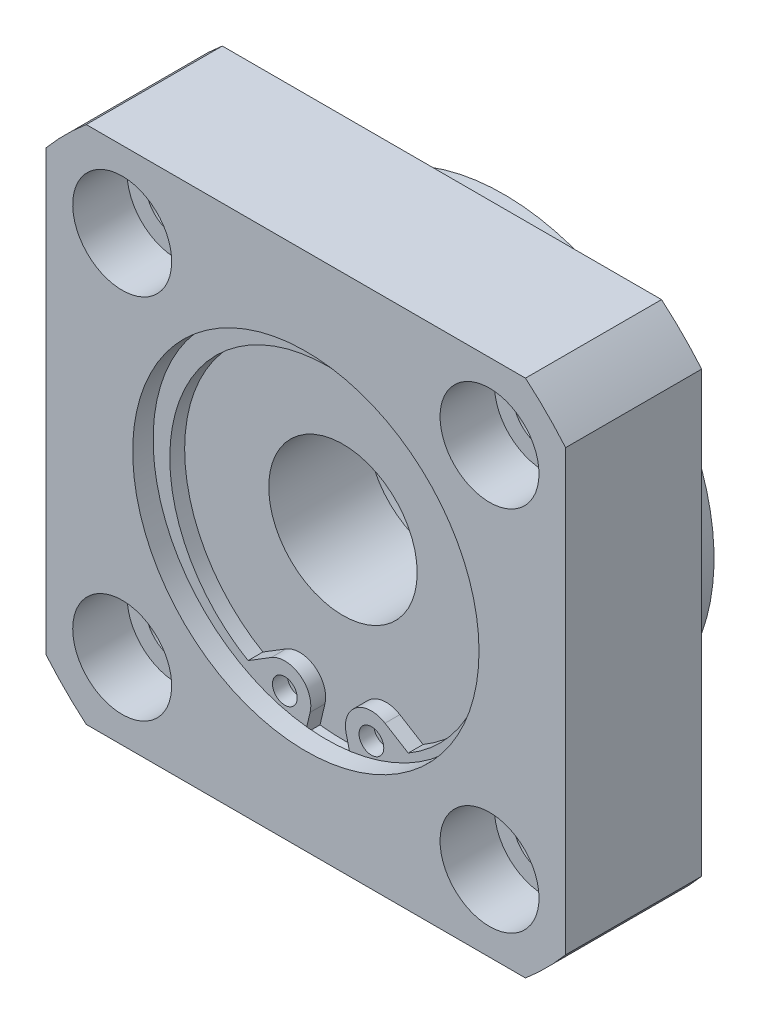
ISO-10303-21;
HEADER;
FILE_DESCRIPTION(('STEP AP214'),'2;1');
FILE_NAME('part.step','',(''),(''),'','','');
FILE_SCHEMA(('AUTOMOTIVE_DESIGN { 1 0 10303 214 1 1 1 1 }'));
ENDSEC;
DATA;
#1=APPLICATION_CONTEXT('core data for automotive mechanical design processes');
#2=APPLICATION_PROTOCOL_DEFINITION('international standard','automotive_design',2000,#1);
#3=PRODUCT_CONTEXT('',#1,'mechanical');
#4=PRODUCT('Part','Part','',(#3));
#5=PRODUCT_RELATED_PRODUCT_CATEGORY('part','',(#4));
#6=PRODUCT_DEFINITION_FORMATION('','',#4);
#7=PRODUCT_DEFINITION_CONTEXT('part definition',#1,'design');
#8=PRODUCT_DEFINITION('design','',#6,#7);
#9=PRODUCT_DEFINITION_SHAPE('','',#8);
#10=(LENGTH_UNIT() NAMED_UNIT(*) SI_UNIT(.MILLI.,.METRE.));
#11=(NAMED_UNIT(*) PLANE_ANGLE_UNIT() SI_UNIT($,.RADIAN.));
#12=(NAMED_UNIT(*) SI_UNIT($,.STERADIAN.) SOLID_ANGLE_UNIT());
#13=UNCERTAINTY_MEASURE_WITH_UNIT(LENGTH_MEASURE(1.E-05),#10,'distance_accuracy_value','');
#14=(GEOMETRIC_REPRESENTATION_CONTEXT(3) GLOBAL_UNCERTAINTY_ASSIGNED_CONTEXT((#13)) GLOBAL_UNIT_ASSIGNED_CONTEXT((#10,
#11,#12)) REPRESENTATION_CONTEXT('',''));
#15=CARTESIAN_POINT('',(0.,0.,0.));
#16=DIRECTION('',(0.,0.,1.));
#17=DIRECTION('',(1.,0.,0.));
#18=AXIS2_PLACEMENT_3D('',#15,#16,#17);
#19=CARTESIAN_POINT('',(14.8492424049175,14.8492424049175,0.));
#20=DIRECTION('',(0.,0.,1.));
#21=DIRECTION('',(1.,0.,0.));
#22=AXIS2_PLACEMENT_3D('',#19,#20,#21);
#23=CYLINDRICAL_SURFACE('',#22,2.5);
#24=CARTESIAN_POINT('',(14.8492424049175,14.8492424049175,0.));
#25=DIRECTION('',(0.,0.,1.));
#26=DIRECTION('',(1.,0.,0.));
#27=AXIS2_PLACEMENT_3D('',#24,#25,#26);
#28=CIRCLE('',#27,2.5);
#29=CARTESIAN_POINT('',(17.3492424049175,14.8492424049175,0.));
#30=VERTEX_POINT('',#29);
#31=EDGE_CURVE('E340',#30,#30,#28,.T.);
#32=ORIENTED_EDGE('',*,*,#31,.F.);
#33=EDGE_LOOP('',(#32));
#34=FACE_BOUND('',#33,.T.);
#35=CARTESIAN_POINT('',(14.8492424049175,14.8492424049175,6.6));
#36=DIRECTION('',(0.,0.,1.));
#37=DIRECTION('',(1.,0.,0.));
#38=AXIS2_PLACEMENT_3D('',#35,#36,#37);
#39=CIRCLE('',#38,2.5);
#40=CARTESIAN_POINT('',(17.3492424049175,14.8492424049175,6.6));
#41=VERTEX_POINT('',#40);
#42=EDGE_CURVE('E339',#41,#41,#39,.F.);
#43=ORIENTED_EDGE('',*,*,#42,.F.);
#44=EDGE_LOOP('',(#43));
#45=FACE_BOUND('',#44,.T.);
#46=ADVANCED_FACE('F14',(#34,#45),#23,.F.);
#47=CARTESIAN_POINT('',(14.8492424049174,-14.8492424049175,0.));
#48=DIRECTION('',(0.,0.,1.));
#49=DIRECTION('',(1.,0.,0.));
#50=AXIS2_PLACEMENT_3D('',#47,#48,#49);
#51=CYLINDRICAL_SURFACE('',#50,2.5);
#52=CARTESIAN_POINT('',(14.8492424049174,-14.8492424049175,0.));
#53=DIRECTION('',(0.,0.,1.));
#54=DIRECTION('',(0.,-1.,0.));
#55=AXIS2_PLACEMENT_3D('',#52,#53,#54);
#56=CIRCLE('',#55,2.5);
#57=CARTESIAN_POINT('',(14.8492424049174,-17.3492424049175,0.));
#58=VERTEX_POINT('',#57);
#59=EDGE_CURVE('E330',#58,#58,#56,.T.);
#60=ORIENTED_EDGE('',*,*,#59,.F.);
#61=EDGE_LOOP('',(#60));
#62=FACE_BOUND('',#61,.T.);
#63=CARTESIAN_POINT('',(14.8492424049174,-14.8492424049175,6.6));
#64=DIRECTION('',(0.,0.,1.));
#65=DIRECTION('',(1.,0.,0.));
#66=AXIS2_PLACEMENT_3D('',#63,#64,#65);
#67=CIRCLE('',#66,2.5);
#68=CARTESIAN_POINT('',(17.3492424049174,-14.8492424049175,6.6));
#69=VERTEX_POINT('',#68);
#70=EDGE_CURVE('E323',#69,#69,#67,.F.);
#71=ORIENTED_EDGE('',*,*,#70,.F.);
#72=EDGE_LOOP('',(#71));
#73=FACE_BOUND('',#72,.T.);
#74=ADVANCED_FACE('F169',(#62,#73),#51,.F.);
#75=CARTESIAN_POINT('',(-14.8492424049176,-14.8492424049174,0.));
#76=DIRECTION('',(0.,0.,1.));
#77=DIRECTION('',(1.,0.,0.));
#78=AXIS2_PLACEMENT_3D('',#75,#76,#77);
#79=CYLINDRICAL_SURFACE('',#78,2.5);
#80=CARTESIAN_POINT('',(-14.8492424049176,-14.8492424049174,0.));
#81=DIRECTION('',(0.,0.,1.));
#82=DIRECTION('',(-1.,0.,0.));
#83=AXIS2_PLACEMENT_3D('',#80,#81,#82);
#84=CIRCLE('',#83,2.5);
#85=CARTESIAN_POINT('',(-17.3492424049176,-14.8492424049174,0.));
#86=VERTEX_POINT('',#85);
#87=EDGE_CURVE('E327',#86,#86,#84,.T.);
#88=ORIENTED_EDGE('',*,*,#87,.F.);
#89=EDGE_LOOP('',(#88));
#90=FACE_BOUND('',#89,.T.);
#91=CARTESIAN_POINT('',(-14.8492424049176,-14.8492424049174,6.6));
#92=DIRECTION('',(0.,0.,1.));
#93=DIRECTION('',(1.,0.,0.));
#94=AXIS2_PLACEMENT_3D('',#91,#92,#93);
#95=CIRCLE('',#94,2.5);
#96=CARTESIAN_POINT('',(-12.3492424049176,-14.8492424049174,6.6));
#97=VERTEX_POINT('',#96);
#98=EDGE_CURVE('E316',#97,#97,#95,.F.);
#99=ORIENTED_EDGE('',*,*,#98,.F.);
#100=EDGE_LOOP('',(#99));
#101=FACE_BOUND('',#100,.T.);
#102=ADVANCED_FACE('F175',(#90,#101),#79,.F.);
#103=CARTESIAN_POINT('',(-14.8492424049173,14.8492424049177,0.));
#104=DIRECTION('',(0.,0.,1.));
#105=DIRECTION('',(1.,0.,0.));
#106=AXIS2_PLACEMENT_3D('',#103,#104,#105);
#107=CYLINDRICAL_SURFACE('',#106,2.5);
#108=CARTESIAN_POINT('',(-14.8492424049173,14.8492424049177,0.));
#109=DIRECTION('',(0.,0.,1.));
#110=DIRECTION('',(0.,1.,0.));
#111=AXIS2_PLACEMENT_3D('',#108,#109,#110);
#112=CIRCLE('',#111,2.5);
#113=CARTESIAN_POINT('',(-14.8492424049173,17.3492424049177,0.));
#114=VERTEX_POINT('',#113);
#115=EDGE_CURVE('E324',#114,#114,#112,.T.);
#116=ORIENTED_EDGE('',*,*,#115,.F.);
#117=EDGE_LOOP('',(#116));
#118=FACE_BOUND('',#117,.T.);
#119=CARTESIAN_POINT('',(-14.8492424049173,14.8492424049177,6.6));
#120=DIRECTION('',(0.,0.,1.));
#121=DIRECTION('',(1.,0.,0.));
#122=AXIS2_PLACEMENT_3D('',#119,#120,#121);
#123=CIRCLE('',#122,2.5);
#124=CARTESIAN_POINT('',(-12.3492424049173,14.8492424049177,6.6));
#125=VERTEX_POINT('',#124);
#126=EDGE_CURVE('E309',#125,#125,#123,.F.);
#127=ORIENTED_EDGE('',*,*,#126,.F.);
#128=EDGE_LOOP('',(#127));
#129=FACE_BOUND('',#128,.T.);
#130=ADVANCED_FACE('F784',(#118,#129),#107,.F.);
#131=CARTESIAN_POINT('',(0.,0.,-5.));
#132=DIRECTION('',(0.,0.,1.));
#133=DIRECTION('',(1.,0.,0.));
#134=AXIS2_PLACEMENT_3D('',#131,#132,#133);
#135=CYLINDRICAL_SURFACE('',#134,17.);
#136=CARTESIAN_POINT('',(0.,0.,-5.));
#137=DIRECTION('',(0.,0.,-1.));
#138=DIRECTION('',(-1.,0.,0.));
#139=AXIS2_PLACEMENT_3D('',#136,#137,#138);
#140=CIRCLE('',#139,17.);
#141=CARTESIAN_POINT('',(-17.,0.,-5.));
#142=VERTEX_POINT('',#141);
#143=EDGE_CURVE('E292',#142,#142,#140,.T.);
#144=ORIENTED_EDGE('',*,*,#143,.F.);
#145=EDGE_LOOP('',(#144));
#146=FACE_BOUND('',#145,.T.);
#147=CARTESIAN_POINT('',(0.,0.,0.));
#148=DIRECTION('',(0.,0.,-1.));
#149=DIRECTION('',(-1.,0.,0.));
#150=AXIS2_PLACEMENT_3D('',#147,#148,#149);
#151=CIRCLE('',#150,17.);
#152=CARTESIAN_POINT('',(-17.,0.,0.));
#153=VERTEX_POINT('',#152);
#154=EDGE_CURVE('E293',#153,#153,#151,.T.);
#155=ORIENTED_EDGE('',*,*,#154,.T.);
#156=EDGE_LOOP('',(#155));
#157=FACE_BOUND('',#156,.T.);
#158=ADVANCED_FACE('F194',(#146,#157),#135,.T.);
#159=CARTESIAN_POINT('',(0.,0.,0.));
#160=DIRECTION('',(0.,0.,-1.));
#161=DIRECTION('',(-1.,0.,0.));
#162=AXIS2_PLACEMENT_3D('',#159,#160,#161);
#163=PLANE('',#162);
#164=ORIENTED_EDGE('',*,*,#154,.F.);
#165=EDGE_LOOP('',(#164));
#166=FACE_BOUND('',#165,.T.);
#167=ORIENTED_EDGE('',*,*,#115,.T.);
#168=EDGE_LOOP('',(#167));
#169=FACE_BOUND('',#168,.T.);
#170=ORIENTED_EDGE('',*,*,#87,.T.);
#171=EDGE_LOOP('',(#170));
#172=FACE_BOUND('',#171,.T.);
#173=ORIENTED_EDGE('',*,*,#59,.T.);
#174=EDGE_LOOP('',(#173));
#175=FACE_BOUND('',#174,.T.);
#176=ORIENTED_EDGE('',*,*,#31,.T.);
#177=EDGE_LOOP('',(#176));
#178=FACE_BOUND('',#177,.T.);
#179=CARTESIAN_POINT('',(0.,0.,0.));
#180=DIRECTION('',(0.,0.,-1.));
#181=DIRECTION('',(-1.,0.,0.));
#182=AXIS2_PLACEMENT_3D('',#179,#180,#181);
#183=CIRCLE('',#182,27.5);
#184=CARTESIAN_POINT('',(21.,-17.7552809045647,0.));
#185=VERTEX_POINT('',#184);
#186=CARTESIAN_POINT('',(17.7552809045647,-21.,0.));
#187=VERTEX_POINT('',#186);
#188=EDGE_CURVE('E346',#185,#187,#183,.T.);
#189=ORIENTED_EDGE('',*,*,#188,.T.);
#190=DIRECTION('',(1.,0.,0.));
#191=VECTOR('',#190,1.);
#192=CARTESIAN_POINT('',(-17.7552809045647,-21.,0.));
#193=LINE('',#192,#191);
#194=CARTESIAN_POINT('',(-17.7552809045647,-21.,0.));
#195=VERTEX_POINT('',#194);
#196=EDGE_CURVE('E349',#195,#187,#193,.T.);
#197=ORIENTED_EDGE('',*,*,#196,.F.);
#198=CARTESIAN_POINT('',(0.,0.,0.));
#199=DIRECTION('',(0.,0.,1.));
#200=DIRECTION('',(1.,0.,0.));
#201=AXIS2_PLACEMENT_3D('',#198,#199,#200);
#202=CIRCLE('',#201,27.5);
#203=CARTESIAN_POINT('',(-21.,-17.7552809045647,0.));
#204=VERTEX_POINT('',#203);
#205=EDGE_CURVE('E352',#204,#195,#202,.T.);
#206=ORIENTED_EDGE('',*,*,#205,.F.);
#207=DIRECTION('',(0.,-1.,0.));
#208=VECTOR('',#207,1.);
#209=CARTESIAN_POINT('',(-21.,17.7552809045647,0.));
#210=LINE('',#209,#208);
#211=CARTESIAN_POINT('',(-21.,17.7552809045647,0.));
#212=VERTEX_POINT('',#211);
#213=EDGE_CURVE('E355',#212,#204,#210,.T.);
#214=ORIENTED_EDGE('',*,*,#213,.F.);
#215=CARTESIAN_POINT('',(0.,0.,0.));
#216=DIRECTION('',(0.,0.,-1.));
#217=DIRECTION('',(-1.,0.,0.));
#218=AXIS2_PLACEMENT_3D('',#215,#216,#217);
#219=CIRCLE('',#218,27.5);
#220=CARTESIAN_POINT('',(-17.7552809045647,21.,0.));
#221=VERTEX_POINT('',#220);
#222=EDGE_CURVE('E358',#212,#221,#219,.T.);
#223=ORIENTED_EDGE('',*,*,#222,.T.);
#224=DIRECTION('',(1.,0.,0.));
#225=VECTOR('',#224,1.);
#226=CARTESIAN_POINT('',(-17.7552809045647,21.,0.));
#227=LINE('',#226,#225);
#228=CARTESIAN_POINT('',(17.7552809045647,21.,0.));
#229=VERTEX_POINT('',#228);
#230=EDGE_CURVE('E361',#221,#229,#227,.T.);
#231=ORIENTED_EDGE('',*,*,#230,.T.);
#232=CARTESIAN_POINT('',(0.,0.,0.));
#233=DIRECTION('',(0.,0.,1.));
#234=DIRECTION('',(1.,0.,0.));
#235=AXIS2_PLACEMENT_3D('',#232,#233,#234);
#236=CIRCLE('',#235,27.5);
#237=CARTESIAN_POINT('',(21.,17.7552809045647,0.));
#238=VERTEX_POINT('',#237);
#239=EDGE_CURVE('E364',#238,#229,#236,.T.);
#240=ORIENTED_EDGE('',*,*,#239,.F.);
#241=DIRECTION('',(0.,-1.,0.));
#242=VECTOR('',#241,1.);
#243=CARTESIAN_POINT('',(21.,17.7552809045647,0.));
#244=LINE('',#243,#242);
#245=EDGE_CURVE('E367',#238,#185,#244,.T.);
#246=ORIENTED_EDGE('',*,*,#245,.T.);
#247=EDGE_LOOP('',(#189,#197,#206,#214,#223,#231,#240,#246));
#248=FACE_BOUND('',#247,.T.);
#249=ADVANCED_FACE('F190',(#166,#169,#172,#175,#178,#248),#163,.T.);
#250=CARTESIAN_POINT('',(14.8492424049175,14.8492424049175,6.6));
#251=DIRECTION('',(0.,0.,1.));
#252=DIRECTION('',(1.,0.,0.));
#253=AXIS2_PLACEMENT_3D('',#250,#251,#252);
#254=PLANE('',#253);
#255=CARTESIAN_POINT('',(14.8492424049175,14.8492424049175,6.6));
#256=DIRECTION('',(0.,0.,1.));
#257=DIRECTION('',(1.,0.,0.));
#258=AXIS2_PLACEMENT_3D('',#255,#256,#257);
#259=CIRCLE('',#258,4.);
#260=CARTESIAN_POINT('',(18.8492424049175,14.8492424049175,6.6));
#261=VERTEX_POINT('',#260);
#262=EDGE_CURVE('E336',#261,#261,#259,.T.);
#263=ORIENTED_EDGE('',*,*,#262,.T.);
#264=EDGE_LOOP('',(#263));
#265=FACE_BOUND('',#264,.T.);
#266=ORIENTED_EDGE('',*,*,#42,.T.);
#267=EDGE_LOOP('',(#266));
#268=FACE_BOUND('',#267,.T.);
#269=ADVANCED_FACE('F193',(#265,#268),#254,.T.);
#270=CARTESIAN_POINT('',(14.8492424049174,-14.8492424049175,6.6));
#271=DIRECTION('',(0.,0.,1.));
#272=DIRECTION('',(0.,-1.,0.));
#273=AXIS2_PLACEMENT_3D('',#270,#271,#272);
#274=PLANE('',#273);
#275=CARTESIAN_POINT('',(14.8492424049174,-14.8492424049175,6.6));
#276=DIRECTION('',(0.,0.,1.));
#277=DIRECTION('',(0.,-1.,0.));
#278=AXIS2_PLACEMENT_3D('',#275,#276,#277);
#279=CIRCLE('',#278,4.);
#280=CARTESIAN_POINT('',(14.8492424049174,-18.8492424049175,6.6));
#281=VERTEX_POINT('',#280);
#282=EDGE_CURVE('E320',#281,#281,#279,.T.);
#283=ORIENTED_EDGE('',*,*,#282,.T.);
#284=EDGE_LOOP('',(#283));
#285=FACE_BOUND('',#284,.T.);
#286=ORIENTED_EDGE('',*,*,#70,.T.);
#287=EDGE_LOOP('',(#286));
#288=FACE_BOUND('',#287,.T.);
#289=ADVANCED_FACE('F791',(#285,#288),#274,.T.);
#290=CARTESIAN_POINT('',(-14.8492424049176,-14.8492424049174,6.6));
#291=DIRECTION('',(0.,0.,1.));
#292=DIRECTION('',(-1.,0.,0.));
#293=AXIS2_PLACEMENT_3D('',#290,#291,#292);
#294=PLANE('',#293);
#295=CARTESIAN_POINT('',(-14.8492424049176,-14.8492424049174,6.6));
#296=DIRECTION('',(0.,0.,1.));
#297=DIRECTION('',(-1.,0.,0.));
#298=AXIS2_PLACEMENT_3D('',#295,#296,#297);
#299=CIRCLE('',#298,4.);
#300=CARTESIAN_POINT('',(-18.8492424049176,-14.8492424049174,6.6));
#301=VERTEX_POINT('',#300);
#302=EDGE_CURVE('E313',#301,#301,#299,.T.);
#303=ORIENTED_EDGE('',*,*,#302,.T.);
#304=EDGE_LOOP('',(#303));
#305=FACE_BOUND('',#304,.T.);
#306=ORIENTED_EDGE('',*,*,#98,.T.);
#307=EDGE_LOOP('',(#306));
#308=FACE_BOUND('',#307,.T.);
#309=ADVANCED_FACE('F808',(#305,#308),#294,.T.);
#310=CARTESIAN_POINT('',(-14.8492424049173,14.8492424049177,6.6));
#311=DIRECTION('',(0.,0.,1.));
#312=DIRECTION('',(0.,1.,0.));
#313=AXIS2_PLACEMENT_3D('',#310,#311,#312);
#314=PLANE('',#313);
#315=CARTESIAN_POINT('',(-14.8492424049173,14.8492424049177,6.6));
#316=DIRECTION('',(0.,0.,1.));
#317=DIRECTION('',(0.,1.,0.));
#318=AXIS2_PLACEMENT_3D('',#315,#316,#317);
#319=CIRCLE('',#318,4.);
#320=CARTESIAN_POINT('',(-14.8492424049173,18.8492424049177,6.6));
#321=VERTEX_POINT('',#320);
#322=EDGE_CURVE('E306',#321,#321,#319,.T.);
#323=ORIENTED_EDGE('',*,*,#322,.T.);
#324=EDGE_LOOP('',(#323));
#325=FACE_BOUND('',#324,.T.);
#326=ORIENTED_EDGE('',*,*,#126,.T.);
#327=EDGE_LOOP('',(#326));
#328=FACE_BOUND('',#327,.T.);
#329=ADVANCED_FACE('F818',(#325,#328),#314,.T.);
#330=CARTESIAN_POINT('',(0.,0.,-5.));
#331=DIRECTION('',(0.,0.,-1.));
#332=DIRECTION('',(-1.,0.,0.));
#333=AXIS2_PLACEMENT_3D('',#330,#331,#332);
#334=PLANE('',#333);
#335=ORIENTED_EDGE('',*,*,#143,.T.);
#336=EDGE_LOOP('',(#335));
#337=FACE_BOUND('',#336,.T.);
#338=CARTESIAN_POINT('',(0.,0.,-5.));
#339=DIRECTION('',(0.,0.,-1.));
#340=DIRECTION('',(-1.,0.,0.));
#341=AXIS2_PLACEMENT_3D('',#338,#339,#340);
#342=CIRCLE('',#341,12.);
#343=CARTESIAN_POINT('',(-12.,0.,-5.));
#344=VERTEX_POINT('',#343);
#345=EDGE_CURVE('E289',#344,#344,#342,.T.);
#346=ORIENTED_EDGE('',*,*,#345,.F.);
#347=EDGE_LOOP('',(#346));
#348=FACE_BOUND('',#347,.T.);
#349=ADVANCED_FACE('F211',(#337,#348),#334,.T.);
#350=CARTESIAN_POINT('',(-17.7552809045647,-21.,11.));
#351=DIRECTION('',(0.,1.,0.));
#352=DIRECTION('',(0.,0.,1.));
#353=AXIS2_PLACEMENT_3D('',#350,#351,#352);
#354=PLANE('',#353);
#355=DIRECTION('',(1.,0.,0.));
#356=VECTOR('',#355,1.);
#357=CARTESIAN_POINT('',(-17.7552809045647,-21.,11.));
#358=LINE('',#357,#356);
#359=CARTESIAN_POINT('',(-17.7552809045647,-21.,11.));
#360=VERTEX_POINT('',#359);
#361=CARTESIAN_POINT('',(17.7552809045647,-21.,11.));
#362=VERTEX_POINT('',#361);
#363=EDGE_CURVE('E373',#360,#362,#358,.T.);
#364=ORIENTED_EDGE('',*,*,#363,.F.);
#365=DIRECTION('',(0.,0.,-1.));
#366=VECTOR('',#365,1.);
#367=CARTESIAN_POINT('',(-17.7552809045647,-21.,11.));
#368=LINE('',#367,#366);
#369=EDGE_CURVE('E397',#360,#195,#368,.T.);
#370=ORIENTED_EDGE('',*,*,#369,.T.);
#371=ORIENTED_EDGE('',*,*,#196,.T.);
#372=DIRECTION('',(0.,0.,-1.));
#373=VECTOR('',#372,1.);
#374=CARTESIAN_POINT('',(17.7552809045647,-21.,11.));
#375=LINE('',#374,#373);
#376=EDGE_CURVE('E394',#362,#187,#375,.T.);
#377=ORIENTED_EDGE('',*,*,#376,.F.);
#378=EDGE_LOOP('',(#364,#370,#371,#377));
#379=FACE_BOUND('',#378,.T.);
#380=ADVANCED_FACE('F207',(#379),#354,.F.);
#381=CARTESIAN_POINT('',(0.,0.,11.));
#382=DIRECTION('',(0.,0.,-1.));
#383=DIRECTION('',(-1.,0.,0.));
#384=AXIS2_PLACEMENT_3D('',#381,#382,#383);
#385=CYLINDRICAL_SURFACE('',#384,27.5);
#386=ORIENTED_EDGE('',*,*,#369,.F.);
#387=CARTESIAN_POINT('',(0.,0.,11.));
#388=DIRECTION('',(0.,0.,1.));
#389=DIRECTION('',(1.,0.,0.));
#390=AXIS2_PLACEMENT_3D('',#387,#388,#389);
#391=CIRCLE('',#390,27.5);
#392=CARTESIAN_POINT('',(-21.,-17.7552809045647,11.));
#393=VERTEX_POINT('',#392);
#394=EDGE_CURVE('E376',#393,#360,#391,.T.);
#395=ORIENTED_EDGE('',*,*,#394,.F.);
#396=DIRECTION('',(0.,0.,-1.));
#397=VECTOR('',#396,1.);
#398=CARTESIAN_POINT('',(-21.,-17.7552809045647,11.));
#399=LINE('',#398,#397);
#400=EDGE_CURVE('E400',#393,#204,#399,.T.);
#401=ORIENTED_EDGE('',*,*,#400,.T.);
#402=ORIENTED_EDGE('',*,*,#205,.T.);
#403=EDGE_LOOP('',(#386,#395,#401,#402));
#404=FACE_BOUND('',#403,.T.);
#405=ADVANCED_FACE('F210',(#404),#385,.T.);
#406=CARTESIAN_POINT('',(-21.,17.7552809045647,11.));
#407=DIRECTION('',(1.,0.,0.));
#408=DIRECTION('',(0.,0.,-1.));
#409=AXIS2_PLACEMENT_3D('',#406,#407,#408);
#410=PLANE('',#409);
#411=ORIENTED_EDGE('',*,*,#400,.F.);
#412=DIRECTION('',(0.,-1.,0.));
#413=VECTOR('',#412,1.);
#414=CARTESIAN_POINT('',(-21.,17.7552809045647,11.));
#415=LINE('',#414,#413);
#416=CARTESIAN_POINT('',(-21.,17.7552809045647,11.));
#417=VERTEX_POINT('',#416);
#418=EDGE_CURVE('E379',#417,#393,#415,.T.);
#419=ORIENTED_EDGE('',*,*,#418,.F.);
#420=DIRECTION('',(0.,0.,-1.));
#421=VECTOR('',#420,1.);
#422=CARTESIAN_POINT('',(-21.,17.7552809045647,11.));
#423=LINE('',#422,#421);
#424=EDGE_CURVE('E403',#417,#212,#423,.T.);
#425=ORIENTED_EDGE('',*,*,#424,.T.);
#426=ORIENTED_EDGE('',*,*,#213,.T.);
#427=EDGE_LOOP('',(#411,#419,#425,#426));
#428=FACE_BOUND('',#427,.T.);
#429=ADVANCED_FACE('F215',(#428),#410,.F.);
#430=CARTESIAN_POINT('',(0.,0.,11.));
#431=DIRECTION('',(0.,0.,-1.));
#432=DIRECTION('',(-1.,0.,0.));
#433=AXIS2_PLACEMENT_3D('',#430,#431,#432);
#434=CYLINDRICAL_SURFACE('',#433,27.5);
#435=ORIENTED_EDGE('',*,*,#424,.F.);
#436=CARTESIAN_POINT('',(0.,0.,11.));
#437=DIRECTION('',(0.,0.,-1.));
#438=DIRECTION('',(-1.,0.,0.));
#439=AXIS2_PLACEMENT_3D('',#436,#437,#438);
#440=CIRCLE('',#439,27.5);
#441=CARTESIAN_POINT('',(-17.7552809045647,21.,11.));
#442=VERTEX_POINT('',#441);
#443=EDGE_CURVE('E382',#417,#442,#440,.T.);
#444=ORIENTED_EDGE('',*,*,#443,.T.);
#445=DIRECTION('',(0.,0.,-1.));
#446=VECTOR('',#445,1.);
#447=CARTESIAN_POINT('',(-17.7552809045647,21.,11.));
#448=LINE('',#447,#446);
#449=EDGE_CURVE('E406',#442,#221,#448,.T.);
#450=ORIENTED_EDGE('',*,*,#449,.T.);
#451=ORIENTED_EDGE('',*,*,#222,.F.);
#452=EDGE_LOOP('',(#435,#444,#450,#451));
#453=FACE_BOUND('',#452,.T.);
#454=ADVANCED_FACE('F219',(#453),#434,.T.);
#455=CARTESIAN_POINT('',(-17.7552809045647,21.,11.));
#456=DIRECTION('',(0.,1.,0.));
#457=DIRECTION('',(0.,0.,1.));
#458=AXIS2_PLACEMENT_3D('',#455,#456,#457);
#459=PLANE('',#458);
#460=ORIENTED_EDGE('',*,*,#449,.F.);
#461=DIRECTION('',(1.,0.,0.));
#462=VECTOR('',#461,1.);
#463=CARTESIAN_POINT('',(-17.7552809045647,21.,11.));
#464=LINE('',#463,#462);
#465=CARTESIAN_POINT('',(17.7552809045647,21.,11.));
#466=VERTEX_POINT('',#465);
#467=EDGE_CURVE('E385',#442,#466,#464,.T.);
#468=ORIENTED_EDGE('',*,*,#467,.T.);
#469=DIRECTION('',(0.,0.,-1.));
#470=VECTOR('',#469,1.);
#471=CARTESIAN_POINT('',(17.7552809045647,21.,11.));
#472=LINE('',#471,#470);
#473=EDGE_CURVE('E409',#466,#229,#472,.T.);
#474=ORIENTED_EDGE('',*,*,#473,.T.);
#475=ORIENTED_EDGE('',*,*,#230,.F.);
#476=EDGE_LOOP('',(#460,#468,#474,#475));
#477=FACE_BOUND('',#476,.T.);
#478=ADVANCED_FACE('F223',(#477),#459,.T.);
#479=CARTESIAN_POINT('',(0.,0.,11.));
#480=DIRECTION('',(0.,0.,-1.));
#481=DIRECTION('',(-1.,0.,0.));
#482=AXIS2_PLACEMENT_3D('',#479,#480,#481);
#483=CYLINDRICAL_SURFACE('',#482,27.5);
#484=ORIENTED_EDGE('',*,*,#473,.F.);
#485=CARTESIAN_POINT('',(0.,0.,11.));
#486=DIRECTION('',(0.,0.,1.));
#487=DIRECTION('',(1.,0.,0.));
#488=AXIS2_PLACEMENT_3D('',#485,#486,#487);
#489=CIRCLE('',#488,27.5);
#490=CARTESIAN_POINT('',(21.,17.7552809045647,11.));
#491=VERTEX_POINT('',#490);
#492=EDGE_CURVE('E388',#491,#466,#489,.T.);
#493=ORIENTED_EDGE('',*,*,#492,.F.);
#494=DIRECTION('',(0.,0.,-1.));
#495=VECTOR('',#494,1.);
#496=CARTESIAN_POINT('',(21.,17.7552809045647,11.));
#497=LINE('',#496,#495);
#498=EDGE_CURVE('E412',#491,#238,#497,.T.);
#499=ORIENTED_EDGE('',*,*,#498,.T.);
#500=ORIENTED_EDGE('',*,*,#239,.T.);
#501=EDGE_LOOP('',(#484,#493,#499,#500));
#502=FACE_BOUND('',#501,.T.);
#503=ADVANCED_FACE('F227',(#502),#483,.T.);
#504=CARTESIAN_POINT('',(21.,17.7552809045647,11.));
#505=DIRECTION('',(1.,0.,0.));
#506=DIRECTION('',(0.,0.,-1.));
#507=AXIS2_PLACEMENT_3D('',#504,#505,#506);
#508=PLANE('',#507);
#509=ORIENTED_EDGE('',*,*,#498,.F.);
#510=DIRECTION('',(0.,-1.,0.));
#511=VECTOR('',#510,1.);
#512=CARTESIAN_POINT('',(21.,17.7552809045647,11.));
#513=LINE('',#512,#511);
#514=CARTESIAN_POINT('',(21.,-17.7552809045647,11.));
#515=VERTEX_POINT('',#514);
#516=EDGE_CURVE('E391',#491,#515,#513,.T.);
#517=ORIENTED_EDGE('',*,*,#516,.T.);
#518=DIRECTION('',(0.,0.,-1.));
#519=VECTOR('',#518,1.);
#520=CARTESIAN_POINT('',(21.,-17.7552809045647,11.));
#521=LINE('',#520,#519);
#522=EDGE_CURVE('E297',#515,#185,#521,.T.);
#523=ORIENTED_EDGE('',*,*,#522,.T.);
#524=ORIENTED_EDGE('',*,*,#245,.F.);
#525=EDGE_LOOP('',(#509,#517,#523,#524));
#526=FACE_BOUND('',#525,.T.);
#527=ADVANCED_FACE('F205',(#526),#508,.T.);
#528=CARTESIAN_POINT('',(0.,0.,11.));
#529=DIRECTION('',(0.,0.,-1.));
#530=DIRECTION('',(-1.,0.,0.));
#531=AXIS2_PLACEMENT_3D('',#528,#529,#530);
#532=CYLINDRICAL_SURFACE('',#531,27.5);
#533=ORIENTED_EDGE('',*,*,#522,.F.);
#534=CARTESIAN_POINT('',(0.,0.,11.));
#535=DIRECTION('',(0.,0.,-1.));
#536=DIRECTION('',(-1.,0.,0.));
#537=AXIS2_PLACEMENT_3D('',#534,#535,#536);
#538=CIRCLE('',#537,27.5);
#539=EDGE_CURVE('E370',#515,#362,#538,.T.);
#540=ORIENTED_EDGE('',*,*,#539,.T.);
#541=ORIENTED_EDGE('',*,*,#376,.T.);
#542=ORIENTED_EDGE('',*,*,#188,.F.);
#543=EDGE_LOOP('',(#533,#540,#541,#542));
#544=FACE_BOUND('',#543,.T.);
#545=ADVANCED_FACE('F202',(#544),#532,.T.);
#546=CARTESIAN_POINT('',(14.8492424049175,14.8492424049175,6.6));
#547=DIRECTION('',(0.,0.,1.));
#548=DIRECTION('',(1.,0.,0.));
#549=AXIS2_PLACEMENT_3D('',#546,#547,#548);
#550=CYLINDRICAL_SURFACE('',#549,4.);
#551=ORIENTED_EDGE('',*,*,#262,.F.);
#552=EDGE_LOOP('',(#551));
#553=FACE_BOUND('',#552,.T.);
#554=CARTESIAN_POINT('',(14.8492424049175,14.8492424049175,11.));
#555=DIRECTION('',(0.,0.,1.));
#556=DIRECTION('',(1.,0.,0.));
#557=AXIS2_PLACEMENT_3D('',#554,#555,#556);
#558=CIRCLE('',#557,4.);
#559=CARTESIAN_POINT('',(18.8492424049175,14.8492424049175,11.));
#560=VERTEX_POINT('',#559);
#561=EDGE_CURVE('E333',#560,#560,#558,.T.);
#562=ORIENTED_EDGE('',*,*,#561,.T.);
#563=EDGE_LOOP('',(#562));
#564=FACE_BOUND('',#563,.T.);
#565=ADVANCED_FACE('F182',(#553,#564),#550,.F.);
#566=CARTESIAN_POINT('',(14.8492424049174,-14.8492424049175,6.6));
#567=DIRECTION('',(0.,0.,1.));
#568=DIRECTION('',(1.,0.,0.));
#569=AXIS2_PLACEMENT_3D('',#566,#567,#568);
#570=CYLINDRICAL_SURFACE('',#569,4.);
#571=ORIENTED_EDGE('',*,*,#282,.F.);
#572=EDGE_LOOP('',(#571));
#573=FACE_BOUND('',#572,.T.);
#574=CARTESIAN_POINT('',(14.8492424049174,-14.8492424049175,11.));
#575=DIRECTION('',(0.,0.,1.));
#576=DIRECTION('',(0.,-1.,0.));
#577=AXIS2_PLACEMENT_3D('',#574,#575,#576);
#578=CIRCLE('',#577,4.);
#579=CARTESIAN_POINT('',(14.8492424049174,-18.8492424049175,11.));
#580=VERTEX_POINT('',#579);
#581=EDGE_CURVE('E317',#580,#580,#578,.T.);
#582=ORIENTED_EDGE('',*,*,#581,.T.);
#583=EDGE_LOOP('',(#582));
#584=FACE_BOUND('',#583,.T.);
#585=ADVANCED_FACE('F725',(#573,#584),#570,.F.);
#586=CARTESIAN_POINT('',(-14.8492424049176,-14.8492424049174,6.6));
#587=DIRECTION('',(0.,0.,1.));
#588=DIRECTION('',(1.,0.,0.));
#589=AXIS2_PLACEMENT_3D('',#586,#587,#588);
#590=CYLINDRICAL_SURFACE('',#589,4.);
#591=ORIENTED_EDGE('',*,*,#302,.F.);
#592=EDGE_LOOP('',(#591));
#593=FACE_BOUND('',#592,.T.);
#594=CARTESIAN_POINT('',(-14.8492424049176,-14.8492424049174,11.));
#595=DIRECTION('',(0.,0.,1.));
#596=DIRECTION('',(-1.,0.,0.));
#597=AXIS2_PLACEMENT_3D('',#594,#595,#596);
#598=CIRCLE('',#597,4.);
#599=CARTESIAN_POINT('',(-18.8492424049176,-14.8492424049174,11.));
#600=VERTEX_POINT('',#599);
#601=EDGE_CURVE('E310',#600,#600,#598,.T.);
#602=ORIENTED_EDGE('',*,*,#601,.T.);
#603=EDGE_LOOP('',(#602));
#604=FACE_BOUND('',#603,.T.);
#605=ADVANCED_FACE('F733',(#593,#604),#590,.F.);
#606=CARTESIAN_POINT('',(-14.8492424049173,14.8492424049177,6.6));
#607=DIRECTION('',(0.,0.,1.));
#608=DIRECTION('',(1.,0.,0.));
#609=AXIS2_PLACEMENT_3D('',#606,#607,#608);
#610=CYLINDRICAL_SURFACE('',#609,4.);
#611=ORIENTED_EDGE('',*,*,#322,.F.);
#612=EDGE_LOOP('',(#611));
#613=FACE_BOUND('',#612,.T.);
#614=CARTESIAN_POINT('',(-14.8492424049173,14.8492424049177,11.));
#615=DIRECTION('',(0.,0.,1.));
#616=DIRECTION('',(0.,1.,0.));
#617=AXIS2_PLACEMENT_3D('',#614,#615,#616);
#618=CIRCLE('',#617,4.);
#619=CARTESIAN_POINT('',(-14.8492424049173,18.8492424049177,11.));
#620=VERTEX_POINT('',#619);
#621=EDGE_CURVE('E303',#620,#620,#618,.T.);
#622=ORIENTED_EDGE('',*,*,#621,.T.);
#623=EDGE_LOOP('',(#622));
#624=FACE_BOUND('',#623,.T.);
#625=ADVANCED_FACE('F742',(#613,#624),#610,.F.);
#626=CARTESIAN_POINT('',(0.,0.,-5.));
#627=DIRECTION('',(0.,0.,1.));
#628=DIRECTION('',(1.,0.,0.));
#629=AXIS2_PLACEMENT_3D('',#626,#627,#628);
#630=CYLINDRICAL_SURFACE('',#629,12.);
#631=ORIENTED_EDGE('',*,*,#345,.T.);
#632=EDGE_LOOP('',(#631));
#633=FACE_BOUND('',#632,.T.);
#634=CARTESIAN_POINT('',(0.,0.,0.));
#635=DIRECTION('',(0.,0.,-1.));
#636=DIRECTION('',(-1.,0.,0.));
#637=AXIS2_PLACEMENT_3D('',#634,#635,#636);
#638=CIRCLE('',#637,12.);
#639=CARTESIAN_POINT('',(-12.,0.,0.));
#640=VERTEX_POINT('',#639);
#641=EDGE_CURVE('E286',#640,#640,#638,.T.);
#642=ORIENTED_EDGE('',*,*,#641,.F.);
#643=EDGE_LOOP('',(#642));
#644=FACE_BOUND('',#643,.T.);
#645=ADVANCED_FACE('F200',(#633,#644),#630,.F.);
#646=CARTESIAN_POINT('',(0.,0.,11.));
#647=DIRECTION('',(0.,0.,-1.));
#648=DIRECTION('',(-1.,0.,0.));
#649=AXIS2_PLACEMENT_3D('',#646,#647,#648);
#650=PLANE('',#649);
#651=CARTESIAN_POINT('',(0.,0.,11.));
#652=DIRECTION('',(0.,0.,1.));
#653=DIRECTION('',(1.,0.,0.));
#654=AXIS2_PLACEMENT_3D('',#651,#652,#653);
#655=CIRCLE('',#654,14.);
#656=CARTESIAN_POINT('',(14.,0.,11.));
#657=VERTEX_POINT('',#656);
#658=EDGE_CURVE('E300',#657,#657,#655,.T.);
#659=ORIENTED_EDGE('',*,*,#658,.F.);
#660=EDGE_LOOP('',(#659));
#661=FACE_BOUND('',#660,.T.);
#662=ORIENTED_EDGE('',*,*,#621,.F.);
#663=EDGE_LOOP('',(#662));
#664=FACE_BOUND('',#663,.T.);
#665=ORIENTED_EDGE('',*,*,#601,.F.);
#666=EDGE_LOOP('',(#665));
#667=FACE_BOUND('',#666,.T.);
#668=ORIENTED_EDGE('',*,*,#581,.F.);
#669=EDGE_LOOP('',(#668));
#670=FACE_BOUND('',#669,.T.);
#671=ORIENTED_EDGE('',*,*,#561,.F.);
#672=EDGE_LOOP('',(#671));
#673=FACE_BOUND('',#672,.T.);
#674=ORIENTED_EDGE('',*,*,#539,.F.);
#675=ORIENTED_EDGE('',*,*,#516,.F.);
#676=ORIENTED_EDGE('',*,*,#492,.T.);
#677=ORIENTED_EDGE('',*,*,#467,.F.);
#678=ORIENTED_EDGE('',*,*,#443,.F.);
#679=ORIENTED_EDGE('',*,*,#418,.T.);
#680=ORIENTED_EDGE('',*,*,#394,.T.);
#681=ORIENTED_EDGE('',*,*,#363,.T.);
#682=EDGE_LOOP('',(#674,#675,#676,#677,#678,#679,#680,#681));
#683=FACE_BOUND('',#682,.T.);
#684=ADVANCED_FACE('F197',(#661,#664,#667,#670,#673,#683),#650,.F.);
#685=CARTESIAN_POINT('',(0.,0.,0.));
#686=DIRECTION('',(0.,0.,1.));
#687=DIRECTION('',(1.,0.,0.));
#688=AXIS2_PLACEMENT_3D('',#685,#686,#687);
#689=CIRCLE('',#688,6.);
#690=CARTESIAN_POINT('',(6.,0.,0.));
#691=VERTEX_POINT('',#690);
#692=EDGE_CURVE('E343',#691,#691,#689,.T.);
#693=ORIENTED_EDGE('',*,*,#692,.T.);
#694=EDGE_LOOP('',(#693));
#695=FACE_BOUND('',#694,.T.);
#696=ORIENTED_EDGE('',*,*,#641,.T.);
#697=EDGE_LOOP('',(#696));
#698=FACE_BOUND('',#697,.T.);
#699=ADVANCED_FACE('F196',(#695,#698),#163,.T.);
#700=CARTESIAN_POINT('',(0.,0.,8.));
#701=DIRECTION('',(0.,0.,1.));
#702=DIRECTION('',(1.,0.,0.));
#703=AXIS2_PLACEMENT_3D('',#700,#701,#702);
#704=CYLINDRICAL_SURFACE('',#703,14.);
#705=CARTESIAN_POINT('',(0.,0.,9.35));
#706=DIRECTION('',(0.,0.,1.));
#707=DIRECTION('',(1.,0.,0.));
#708=AXIS2_PLACEMENT_3D('',#705,#706,#707);
#709=CIRCLE('',#708,14.);
#710=CARTESIAN_POINT('',(14.,0.,9.35));
#711=VERTEX_POINT('',#710);
#712=EDGE_CURVE('E281',#711,#711,#709,.F.);
#713=ORIENTED_EDGE('',*,*,#712,.T.);
#714=EDGE_LOOP('',(#713));
#715=FACE_BOUND('',#714,.T.);
#716=ORIENTED_EDGE('',*,*,#658,.T.);
#717=EDGE_LOOP('',(#716));
#718=FACE_BOUND('',#717,.T.);
#719=ADVANCED_FACE('F188',(#715,#718),#704,.F.);
#720=CARTESIAN_POINT('',(0.,0.,11.));
#721=DIRECTION('',(0.,0.,-1.));
#722=DIRECTION('',(-1.,0.,0.));
#723=AXIS2_PLACEMENT_3D('',#720,#721,#722);
#724=CYLINDRICAL_SURFACE('',#723,6.);
#725=ORIENTED_EDGE('',*,*,#692,.F.);
#726=EDGE_LOOP('',(#725));
#727=FACE_BOUND('',#726,.T.);
#728=CARTESIAN_POINT('',(0.,0.,8.));
#729=DIRECTION('',(0.,0.,1.));
#730=DIRECTION('',(1.,0.,0.));
#731=AXIS2_PLACEMENT_3D('',#728,#729,#730);
#732=CIRCLE('',#731,6.);
#733=CARTESIAN_POINT('',(6.,0.,8.));
#734=VERTEX_POINT('',#733);
#735=EDGE_CURVE('E262',#734,#734,#732,.T.);
#736=ORIENTED_EDGE('',*,*,#735,.T.);
#737=EDGE_LOOP('',(#736));
#738=FACE_BOUND('',#737,.T.);
#739=ADVANCED_FACE('F184',(#727,#738),#724,.F.);
#740=CARTESIAN_POINT('',(0.,0.,8.));
#741=DIRECTION('',(0.,0.,1.));
#742=DIRECTION('',(1.,0.,0.));
#743=AXIS2_PLACEMENT_3D('',#740,#741,#742);
#744=PLANE('',#743);
#745=ORIENTED_EDGE('',*,*,#735,.F.);
#746=EDGE_LOOP('',(#745));
#747=FACE_BOUND('',#746,.T.);
#748=CARTESIAN_POINT('',(0.,0.,8.));
#749=DIRECTION('',(0.,0.,1.));
#750=DIRECTION('',(1.,0.,0.));
#751=AXIS2_PLACEMENT_3D('',#748,#749,#750);
#752=CIRCLE('',#751,14.7);
#753=CARTESIAN_POINT('',(-1.8545147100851,-14.5825503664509,8.));
#754=VERTEX_POINT('',#753);
#755=CARTESIAN_POINT('',(1.85451471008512,-14.5825503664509,8.));
#756=VERTEX_POINT('',#755);
#757=EDGE_CURVE('E267',#754,#756,#752,.T.);
#758=ORIENTED_EDGE('',*,*,#757,.T.);
#759=DIRECTION('',(-0.231349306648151,0.972870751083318,0.));
#760=VECTOR('',#759,1.);
#761=CARTESIAN_POINT('',(-1.52688153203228,-0.363093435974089,8.));
#762=LINE('',#761,#760);
#763=CARTESIAN_POINT('',(1.45697142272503,-12.9108002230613,8.));
#764=VERTEX_POINT('',#763);
#765=EDGE_CURVE('E9',#756,#764,#762,.T.);
#766=ORIENTED_EDGE('',*,*,#765,.T.);
#767=CARTESIAN_POINT('',(3.5,-12.4249666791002,8.));
#768=DIRECTION('',(0.,0.,1.));
#769=DIRECTION('',(1.,0.,0.));
#770=AXIS2_PLACEMENT_3D('',#767,#768,#769);
#771=CIRCLE('',#770,2.1);
#772=CARTESIAN_POINT('',(4.60110316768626,-10.6367911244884,8.));
#773=VERTEX_POINT('',#772);
#774=EDGE_CURVE('E25',#773,#764,#771,.T.);
#775=ORIENTED_EDGE('',*,*,#774,.F.);
#776=DIRECTION('',(0.851512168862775,-0.524334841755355,0.));
#777=VECTOR('',#776,1.);
#778=CARTESIAN_POINT('',(-3.4841202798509,-5.65816073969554,8.));
#779=LINE('',#778,#777);
#780=CARTESIAN_POINT('',(6.47566997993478,-11.7910913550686,8.));
#781=VERTEX_POINT('',#780);
#782=EDGE_CURVE('E452',#773,#781,#779,.T.);
#783=ORIENTED_EDGE('',*,*,#782,.T.);
#784=CARTESIAN_POINT('',(0.,-0.75,8.));
#785=DIRECTION('',(0.,0.,1.));
#786=DIRECTION('',(1.,0.,0.));
#787=AXIS2_PLACEMENT_3D('',#784,#785,#786);
#788=CIRCLE('',#787,12.8);
#789=CARTESIAN_POINT('',(-6.47566997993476,-11.7910913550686,8.));
#790=VERTEX_POINT('',#789);
#791=EDGE_CURVE('E91',#781,#790,#788,.T.);
#792=ORIENTED_EDGE('',*,*,#791,.T.);
#793=DIRECTION('',(0.851512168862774,0.524334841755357,0.));
#794=VECTOR('',#793,1.);
#795=CARTESIAN_POINT('',(3.4841202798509,-5.65816073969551,8.));
#796=LINE('',#795,#794);
#797=CARTESIAN_POINT('',(-4.60110316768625,-10.6367911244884,8.));
#798=VERTEX_POINT('',#797);
#799=EDGE_CURVE('E446',#790,#798,#796,.T.);
#800=ORIENTED_EDGE('',*,*,#799,.T.);
#801=CARTESIAN_POINT('',(-3.5,-12.4249666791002,8.));
#802=DIRECTION('',(0.,0.,1.));
#803=DIRECTION('',(1.,0.,0.));
#804=AXIS2_PLACEMENT_3D('',#801,#802,#803);
#805=CIRCLE('',#804,2.1);
#806=CARTESIAN_POINT('',(-1.45697142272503,-12.9108002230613,8.));
#807=VERTEX_POINT('',#806);
#808=EDGE_CURVE('E441',#807,#798,#805,.T.);
#809=ORIENTED_EDGE('',*,*,#808,.F.);
#810=DIRECTION('',(-0.231349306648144,-0.97287075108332,0.));
#811=VECTOR('',#810,1.);
#812=CARTESIAN_POINT('',(1.52688153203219,-0.363093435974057,8.));
#813=LINE('',#812,#811);
#814=EDGE_CURVE('E272',#807,#754,#813,.T.);
#815=ORIENTED_EDGE('',*,*,#814,.T.);
#816=EDGE_LOOP('',(#758,#766,#775,#783,#792,#800,#809,#815));
#817=FACE_BOUND('',#816,.T.);
#818=ADVANCED_FACE('F187',(#747,#817),#744,.T.);
#819=CARTESIAN_POINT('',(0.,0.,9.35));
#820=DIRECTION('',(0.,0.,1.));
#821=DIRECTION('',(1.,0.,0.));
#822=AXIS2_PLACEMENT_3D('',#819,#820,#821);
#823=PLANE('',#822);
#824=CARTESIAN_POINT('',(0.,0.,9.35));
#825=DIRECTION('',(0.,0.,1.));
#826=DIRECTION('',(1.,0.,0.));
#827=AXIS2_PLACEMENT_3D('',#824,#825,#826);
#828=CIRCLE('',#827,14.7);
#829=CARTESIAN_POINT('',(14.7,0.,9.35));
#830=VERTEX_POINT('',#829);
#831=EDGE_CURVE('E278',#830,#830,#828,.T.);
#832=ORIENTED_EDGE('',*,*,#831,.F.);
#833=EDGE_LOOP('',(#832));
#834=FACE_BOUND('',#833,.T.);
#835=ORIENTED_EDGE('',*,*,#712,.F.);
#836=EDGE_LOOP('',(#835));
#837=FACE_BOUND('',#836,.T.);
#838=ADVANCED_FACE('F165',(#834,#837),#823,.F.);
#839=CARTESIAN_POINT('',(0.,0.,9.35));
#840=DIRECTION('',(0.,0.,-1.));
#841=DIRECTION('',(-1.,0.,0.));
#842=AXIS2_PLACEMENT_3D('',#839,#840,#841);
#843=CYLINDRICAL_SURFACE('',#842,14.7);
#844=ORIENTED_EDGE('',*,*,#831,.T.);
#845=EDGE_LOOP('',(#844));
#846=FACE_BOUND('',#845,.T.);
#847=CARTESIAN_POINT('',(0.,0.,9.2));
#848=DIRECTION('',(0.,0.,-1.));
#849=DIRECTION('',(-1.,0.,0.));
#850=AXIS2_PLACEMENT_3D('',#847,#848,#849);
#851=CIRCLE('',#850,14.7);
#852=CARTESIAN_POINT('',(-1.8545147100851,-14.5825503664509,9.2));
#853=VERTEX_POINT('',#852);
#854=CARTESIAN_POINT('',(1.85451471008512,-14.5825503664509,9.2));
#855=VERTEX_POINT('',#854);
#856=EDGE_CURVE('E429',#853,#855,#851,.T.);
#857=ORIENTED_EDGE('',*,*,#856,.T.);
#858=DIRECTION('',(0.,0.,-1.));
#859=VECTOR('',#858,1.);
#860=CARTESIAN_POINT('',(1.85451471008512,-14.5825503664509,9.35));
#861=LINE('',#860,#859);
#862=EDGE_CURVE('E432',#855,#756,#861,.T.);
#863=ORIENTED_EDGE('',*,*,#862,.T.);
#864=ORIENTED_EDGE('',*,*,#757,.F.);
#865=DIRECTION('',(0.,0.,-1.));
#866=VECTOR('',#865,1.);
#867=CARTESIAN_POINT('',(-1.8545147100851,-14.5825503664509,9.35));
#868=LINE('',#867,#866);
#869=EDGE_CURVE('E296',#754,#853,#868,.F.);
#870=ORIENTED_EDGE('',*,*,#869,.T.);
#871=EDGE_LOOP('',(#857,#863,#864,#870));
#872=FACE_BOUND('',#871,.T.);
#873=ADVANCED_FACE('F148',(#846,#872),#843,.F.);
#874=CARTESIAN_POINT('',(3.5,-12.4249666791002,8.));
#875=DIRECTION('',(0.,0.,1.));
#876=DIRECTION('',(1.,0.,0.));
#877=AXIS2_PLACEMENT_3D('',#874,#875,#876);
#878=CIRCLE('',#877,1.);
#879=CARTESIAN_POINT('',(4.5,-12.4249666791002,8.));
#880=VERTEX_POINT('',#879);
#881=EDGE_CURVE('E434',#880,#880,#878,.T.);
#882=ORIENTED_EDGE('',*,*,#881,.T.);
#883=EDGE_LOOP('',(#882));
#884=FACE_BOUND('',#883,.T.);
#885=ADVANCED_FACE('F164',(#884),#744,.T.);
#886=CARTESIAN_POINT('',(-3.5,-12.4249666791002,8.));
#887=DIRECTION('',(0.,0.,1.));
#888=DIRECTION('',(1.,0.,0.));
#889=AXIS2_PLACEMENT_3D('',#886,#887,#888);
#890=CIRCLE('',#889,1.);
#891=CARTESIAN_POINT('',(-2.5,-12.4249666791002,8.));
#892=VERTEX_POINT('',#891);
#893=EDGE_CURVE('E437',#892,#892,#890,.T.);
#894=ORIENTED_EDGE('',*,*,#893,.T.);
#895=EDGE_LOOP('',(#894));
#896=FACE_BOUND('',#895,.T.);
#897=ADVANCED_FACE('F242',(#896),#744,.T.);
#898=CARTESIAN_POINT('',(4.60110316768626,-10.6367911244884,9.2));
#899=DIRECTION('',(-0.524334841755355,-0.851512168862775,0.));
#900=DIRECTION('',(-0.851512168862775,0.524334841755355,0.));
#901=AXIS2_PLACEMENT_3D('',#898,#899,#900);
#902=PLANE('',#901);
#903=ORIENTED_EDGE('',*,*,#782,.F.);
#904=DIRECTION('',(0.,0.,-1.));
#905=VECTOR('',#904,1.);
#906=CARTESIAN_POINT('',(4.60110316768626,-10.6367911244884,9.2));
#907=LINE('',#906,#905);
#908=CARTESIAN_POINT('',(4.60110316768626,-10.6367911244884,9.2));
#909=VERTEX_POINT('',#908);
#910=EDGE_CURVE('E67',#909,#773,#907,.T.);
#911=ORIENTED_EDGE('',*,*,#910,.F.);
#912=DIRECTION('',(-0.851512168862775,0.524334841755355,0.));
#913=VECTOR('',#912,1.);
#914=CARTESIAN_POINT('',(4.60110316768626,-10.6367911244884,9.2));
#915=LINE('',#914,#913);
#916=CARTESIAN_POINT('',(6.47566997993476,-11.7910913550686,9.2));
#917=VERTEX_POINT('',#916);
#918=EDGE_CURVE('E78',#917,#909,#915,.T.);
#919=ORIENTED_EDGE('',*,*,#918,.F.);
#920=DIRECTION('',(0.,0.,-1.));
#921=VECTOR('',#920,1.);
#922=CARTESIAN_POINT('',(6.47566997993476,-11.7910913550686,9.2));
#923=LINE('',#922,#921);
#924=EDGE_CURVE('E88',#917,#781,#923,.T.);
#925=ORIENTED_EDGE('',*,*,#924,.T.);
#926=EDGE_LOOP('',(#903,#911,#919,#925));
#927=FACE_BOUND('',#926,.T.);
#928=ADVANCED_FACE('F95',(#927),#902,.F.);
#929=CARTESIAN_POINT('',(0.,-0.75,9.2));
#930=DIRECTION('',(0.,0.,1.));
#931=DIRECTION('',(-1.,0.,0.));
#932=AXIS2_PLACEMENT_3D('',#929,#930,#931);
#933=CYLINDRICAL_SURFACE('',#932,12.8);
#934=ORIENTED_EDGE('',*,*,#791,.F.);
#935=ORIENTED_EDGE('',*,*,#924,.F.);
#936=CARTESIAN_POINT('',(0.,-0.75,9.2));
#937=DIRECTION('',(0.,0.,-1.));
#938=DIRECTION('',(0.,-1.,0.));
#939=AXIS2_PLACEMENT_3D('',#936,#937,#938);
#940=CIRCLE('',#939,12.8);
#941=CARTESIAN_POINT('',(-6.47566997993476,-11.7910913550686,9.2));
#942=VERTEX_POINT('',#941);
#943=EDGE_CURVE('E73',#942,#917,#940,.T.);
#944=ORIENTED_EDGE('',*,*,#943,.F.);
#945=DIRECTION('',(0.,0.,-1.));
#946=VECTOR('',#945,1.);
#947=CARTESIAN_POINT('',(-6.47566997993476,-11.7910913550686,9.2));
#948=LINE('',#947,#946);
#949=EDGE_CURVE('E93',#942,#790,#948,.T.);
#950=ORIENTED_EDGE('',*,*,#949,.T.);
#951=EDGE_LOOP('',(#934,#935,#944,#950));
#952=FACE_BOUND('',#951,.T.);
#953=ADVANCED_FACE('F89',(#952),#933,.F.);
#954=CARTESIAN_POINT('',(-4.60110316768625,-10.6367911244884,9.2));
#955=DIRECTION('',(0.524334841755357,-0.851512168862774,0.));
#956=DIRECTION('',(0.,0.,-1.));
#957=AXIS2_PLACEMENT_3D('',#954,#955,#956);
#958=PLANE('',#957);
#959=ORIENTED_EDGE('',*,*,#799,.F.);
#960=ORIENTED_EDGE('',*,*,#949,.F.);
#961=DIRECTION('',(-0.851512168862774,-0.524334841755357,0.));
#962=VECTOR('',#961,1.);
#963=CARTESIAN_POINT('',(-4.60110316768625,-10.6367911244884,9.2));
#964=LINE('',#963,#962);
#965=CARTESIAN_POINT('',(-4.60110316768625,-10.6367911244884,9.2));
#966=VERTEX_POINT('',#965);
#967=EDGE_CURVE('E18',#966,#942,#964,.T.);
#968=ORIENTED_EDGE('',*,*,#967,.F.);
#969=DIRECTION('',(0.,0.,-1.));
#970=VECTOR('',#969,1.);
#971=CARTESIAN_POINT('',(-4.60110316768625,-10.6367911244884,9.2));
#972=LINE('',#971,#970);
#973=EDGE_CURVE('E105',#966,#798,#972,.T.);
#974=ORIENTED_EDGE('',*,*,#973,.T.);
#975=EDGE_LOOP('',(#959,#960,#968,#974));
#976=FACE_BOUND('',#975,.T.);
#977=ADVANCED_FACE('F147',(#976),#958,.F.);
#978=CARTESIAN_POINT('',(-3.5,-12.4249666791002,9.2));
#979=DIRECTION('',(0.,0.,1.));
#980=DIRECTION('',(-1.,0.,0.));
#981=AXIS2_PLACEMENT_3D('',#978,#979,#980);
#982=CYLINDRICAL_SURFACE('',#981,1.);
#983=ORIENTED_EDGE('',*,*,#893,.F.);
#984=EDGE_LOOP('',(#983));
#985=FACE_BOUND('',#984,.T.);
#986=CARTESIAN_POINT('',(-3.5,-12.4249666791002,9.2));
#987=DIRECTION('',(0.,0.,-1.));
#988=DIRECTION('',(1.,0.,0.));
#989=AXIS2_PLACEMENT_3D('',#986,#987,#988);
#990=CIRCLE('',#989,1.);
#991=CARTESIAN_POINT('',(-2.5,-12.4249666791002,9.2));
#992=VERTEX_POINT('',#991);
#993=EDGE_CURVE('E117',#992,#992,#990,.T.);
#994=ORIENTED_EDGE('',*,*,#993,.F.);
#995=EDGE_LOOP('',(#994));
#996=FACE_BOUND('',#995,.T.);
#997=ADVANCED_FACE('F16',(#985,#996),#982,.F.);
#998=CARTESIAN_POINT('',(3.5,-12.4249666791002,9.2));
#999=DIRECTION('',(0.,0.,1.));
#1000=DIRECTION('',(-1.,0.,0.));
#1001=AXIS2_PLACEMENT_3D('',#998,#999,#1000);
#1002=CYLINDRICAL_SURFACE('',#1001,1.);
#1003=ORIENTED_EDGE('',*,*,#881,.F.);
#1004=EDGE_LOOP('',(#1003));
#1005=FACE_BOUND('',#1004,.T.);
#1006=CARTESIAN_POINT('',(3.5,-12.4249666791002,9.2));
#1007=DIRECTION('',(0.,0.,1.));
#1008=DIRECTION('',(1.,0.,0.));
#1009=AXIS2_PLACEMENT_3D('',#1006,#1007,#1008);
#1010=CIRCLE('',#1009,1.);
#1011=CARTESIAN_POINT('',(4.5,-12.4249666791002,9.2));
#1012=VERTEX_POINT('',#1011);
#1013=EDGE_CURVE('E111',#1012,#1012,#1010,.T.);
#1014=ORIENTED_EDGE('',*,*,#1013,.T.);
#1015=EDGE_LOOP('',(#1014));
#1016=FACE_BOUND('',#1015,.T.);
#1017=ADVANCED_FACE('F141',(#1005,#1016),#1002,.F.);
#1018=CARTESIAN_POINT('',(3.5,-12.4249666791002,9.2));
#1019=DIRECTION('',(0.,0.,1.));
#1020=DIRECTION('',(-1.,0.,0.));
#1021=AXIS2_PLACEMENT_3D('',#1018,#1019,#1020);
#1022=CYLINDRICAL_SURFACE('',#1021,2.1);
#1023=ORIENTED_EDGE('',*,*,#774,.T.);
#1024=DIRECTION('',(0.,0.,-1.));
#1025=VECTOR('',#1024,1.);
#1026=CARTESIAN_POINT('',(1.45697142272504,-12.9108002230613,9.2));
#1027=LINE('',#1026,#1025);
#1028=CARTESIAN_POINT('',(1.45697142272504,-12.9108002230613,9.2));
#1029=VERTEX_POINT('',#1028);
#1030=EDGE_CURVE('E110',#1029,#764,#1027,.T.);
#1031=ORIENTED_EDGE('',*,*,#1030,.F.);
#1032=CARTESIAN_POINT('',(3.5,-12.4249666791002,9.2));
#1033=DIRECTION('',(0.,0.,1.));
#1034=DIRECTION('',(1.,0.,0.));
#1035=AXIS2_PLACEMENT_3D('',#1032,#1033,#1034);
#1036=CIRCLE('',#1035,2.1);
#1037=EDGE_CURVE('E97',#909,#1029,#1036,.T.);
#1038=ORIENTED_EDGE('',*,*,#1037,.F.);
#1039=ORIENTED_EDGE('',*,*,#910,.T.);
#1040=EDGE_LOOP('',(#1023,#1031,#1038,#1039));
#1041=FACE_BOUND('',#1040,.T.);
#1042=ADVANCED_FACE('F145',(#1041),#1022,.T.);
#1043=CARTESIAN_POINT('',(0.,-0.75,9.2));
#1044=DIRECTION('',(0.,0.,-1.));
#1045=DIRECTION('',(0.,-1.,0.));
#1046=AXIS2_PLACEMENT_3D('',#1043,#1044,#1045);
#1047=PLANE('',#1046);
#1048=ORIENTED_EDGE('',*,*,#1013,.F.);
#1049=EDGE_LOOP('',(#1048));
#1050=FACE_BOUND('',#1049,.T.);
#1051=ORIENTED_EDGE('',*,*,#993,.T.);
#1052=EDGE_LOOP('',(#1051));
#1053=FACE_BOUND('',#1052,.T.);
#1054=ORIENTED_EDGE('',*,*,#856,.F.);
#1055=DIRECTION('',(0.231349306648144,0.97287075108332,0.));
#1056=VECTOR('',#1055,1.);
#1057=CARTESIAN_POINT('',(-1.45697142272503,-12.9108002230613,9.2));
#1058=LINE('',#1057,#1056);
#1059=CARTESIAN_POINT('',(-1.45697142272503,-12.9108002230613,9.2));
#1060=VERTEX_POINT('',#1059);
#1061=EDGE_CURVE('E121',#853,#1060,#1058,.T.);
#1062=ORIENTED_EDGE('',*,*,#1061,.T.);
#1063=CARTESIAN_POINT('',(-3.5,-12.4249666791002,9.2));
#1064=DIRECTION('',(0.,0.,1.));
#1065=DIRECTION('',(-1.,0.,0.));
#1066=AXIS2_PLACEMENT_3D('',#1063,#1064,#1065);
#1067=CIRCLE('',#1066,2.1);
#1068=EDGE_CURVE('E124',#1060,#966,#1067,.T.);
#1069=ORIENTED_EDGE('',*,*,#1068,.T.);
#1070=ORIENTED_EDGE('',*,*,#967,.T.);
#1071=ORIENTED_EDGE('',*,*,#943,.T.);
#1072=ORIENTED_EDGE('',*,*,#918,.T.);
#1073=ORIENTED_EDGE('',*,*,#1037,.T.);
#1074=DIRECTION('',(0.231349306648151,-0.972870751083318,0.));
#1075=VECTOR('',#1074,1.);
#1076=CARTESIAN_POINT('',(1.45697142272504,-12.9108002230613,9.2));
#1077=LINE('',#1076,#1075);
#1078=EDGE_CURVE('E101',#1029,#855,#1077,.T.);
#1079=ORIENTED_EDGE('',*,*,#1078,.T.);
#1080=EDGE_LOOP('',(#1054,#1062,#1069,#1070,#1071,#1072,#1073,#1079));
#1081=FACE_BOUND('',#1080,.T.);
#1082=ADVANCED_FACE('F76',(#1050,#1053,#1081),#1047,.F.);
#1083=CARTESIAN_POINT('',(-3.5,-12.4249666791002,9.2));
#1084=DIRECTION('',(0.,0.,1.));
#1085=DIRECTION('',(-1.,0.,0.));
#1086=AXIS2_PLACEMENT_3D('',#1083,#1084,#1085);
#1087=CYLINDRICAL_SURFACE('',#1086,2.1);
#1088=ORIENTED_EDGE('',*,*,#808,.T.);
#1089=ORIENTED_EDGE('',*,*,#973,.F.);
#1090=ORIENTED_EDGE('',*,*,#1068,.F.);
#1091=DIRECTION('',(0.,0.,-1.));
#1092=VECTOR('',#1091,1.);
#1093=CARTESIAN_POINT('',(-1.45697142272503,-12.9108002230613,9.2));
#1094=LINE('',#1093,#1092);
#1095=EDGE_CURVE('E107',#1060,#807,#1094,.T.);
#1096=ORIENTED_EDGE('',*,*,#1095,.T.);
#1097=EDGE_LOOP('',(#1088,#1089,#1090,#1096));
#1098=FACE_BOUND('',#1097,.T.);
#1099=ADVANCED_FACE('F144',(#1098),#1087,.T.);
#1100=CARTESIAN_POINT('',(-1.45697142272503,-12.9108002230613,9.2));
#1101=DIRECTION('',(-0.97287075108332,0.231349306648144,0.));
#1102=DIRECTION('',(0.,0.,1.));
#1103=AXIS2_PLACEMENT_3D('',#1100,#1101,#1102);
#1104=PLANE('',#1103);
#1105=ORIENTED_EDGE('',*,*,#869,.F.);
#1106=ORIENTED_EDGE('',*,*,#814,.F.);
#1107=ORIENTED_EDGE('',*,*,#1095,.F.);
#1108=ORIENTED_EDGE('',*,*,#1061,.F.);
#1109=EDGE_LOOP('',(#1105,#1106,#1107,#1108));
#1110=FACE_BOUND('',#1109,.T.);
#1111=ADVANCED_FACE('F154',(#1110),#1104,.F.);
#1112=CARTESIAN_POINT('',(1.45697142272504,-12.9108002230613,9.2));
#1113=DIRECTION('',(0.972870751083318,0.231349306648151,0.));
#1114=DIRECTION('',(0.,0.,-1.));
#1115=AXIS2_PLACEMENT_3D('',#1112,#1113,#1114);
#1116=PLANE('',#1115);
#1117=ORIENTED_EDGE('',*,*,#862,.F.);
#1118=ORIENTED_EDGE('',*,*,#1078,.F.);
#1119=ORIENTED_EDGE('',*,*,#1030,.T.);
#1120=ORIENTED_EDGE('',*,*,#765,.F.);
#1121=EDGE_LOOP('',(#1117,#1118,#1119,#1120));
#1122=FACE_BOUND('',#1121,.T.);
#1123=ADVANCED_FACE('F157',(#1122),#1116,.F.);
#1124=CLOSED_SHELL('',(#46,#74,#102,#130,#158,#249,#269,#289,#309,#329,#349,#380,#405,#429,#454,
#478,#503,#527,#545,#565,#585,#605,#625,#645,#684,#699,#719,#739,#818,#838,#873,#885,#897,#928,
#953,#977,#997,#1017,#1042,#1082,#1099,#1111,#1123));
#1125=MANIFOLD_SOLID_BREP('B1',#1124);
#1126=ADVANCED_BREP_SHAPE_REPRESENTATION('',(#18,#1125),#14);
#1127=SHAPE_DEFINITION_REPRESENTATION(#9,#1126);
ENDSEC;
END-ISO-10303-21;
